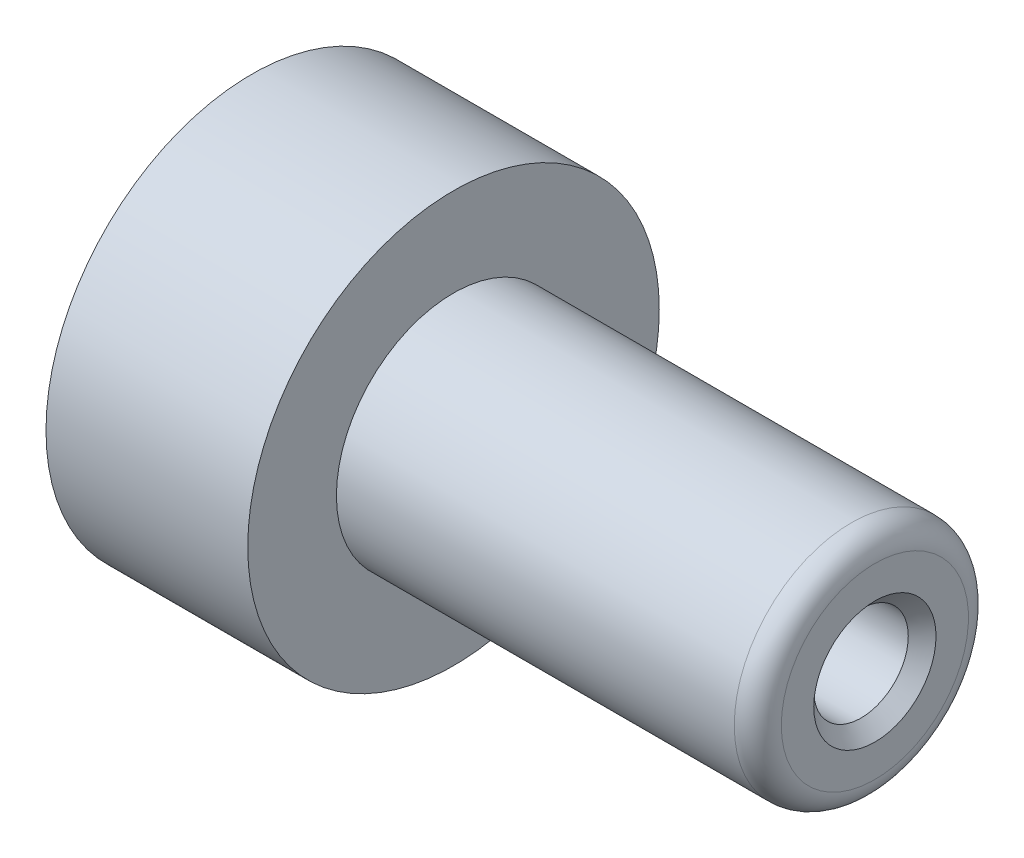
from build123d import *

# Parameters (mm, degrees)
SKETCH2_R          = 1.2065
CUT_EXTRUDE1_DEPTH = 2.54
SKETCH3_R          = 2.5527
CUT_EXTRUDE2_DEPTH = 38.143429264
CHAMFER1_SIZE      = 0.7493


with BuildPart() as part:
    # Sketch1 → Revolve1 (revolve)
    with BuildSketch(Plane.XY, mode=Mode.PRIVATE) as revolve1_sk:
        with BuildLine():
            Line((0, 3.9751), (0, 11.1125))
            Line((0, 11.1125), (10.8966, 11.1125))
            Line((10.8966, 11.1125), (10.8966, 6.3246))
            Line((10.8966, 6.3246), (32.385, 6.3246))
            ThreePointArc((32.385, 6.3246), (33.283025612, 5.952625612), (33.655, 5.0546))
            Line((33.655, 5.0546), (33.655, 0))
            Line((33.655, 0), (21.8948, 0))
            Line((21.8948, 0), (21.8948, 3.9751))
            Line((21.8948, 3.9751), (0, 3.9751))
        make_face()
    revolve(revolve1_sk.sketch.rotate(Axis((0, 0, 0), (1, 0, 0)), 90), axis=Axis((0, 0, 0), (1, 0, 0)))

    # Sketch2 → Cut-Extrude1 (cut)
    with BuildSketch(Plane.ZY):
        with Locations((-6.7437, 0)):
            Circle(SKETCH2_R)
        with Locations(Location((6.7437, 0, 0), (0, 0, 180))):
            Circle(SKETCH2_R)
    extrude(amount=-CUT_EXTRUDE1_DEPTH, mode=Mode.SUBTRACT)

    # Sketch3 → Cut-Extrude2 (cut, through all)
    with BuildSketch(Plane(origin=(33.655, 0, 0), x_dir=(0, 0, -1), z_dir=(1, 0, 0))):
        Circle(SKETCH3_R)
    extrude(amount=-CUT_EXTRUDE2_DEPTH, mode=Mode.SUBTRACT)

    # Chamfer1
    chamfer1_edges = [part.edges().sort_by_distance(p)[0] for p in [
        (33.655, 0, 2.5527),
    ]]
    chamfer(chamfer1_edges, length=CHAMFER1_SIZE)


solid = part.part
